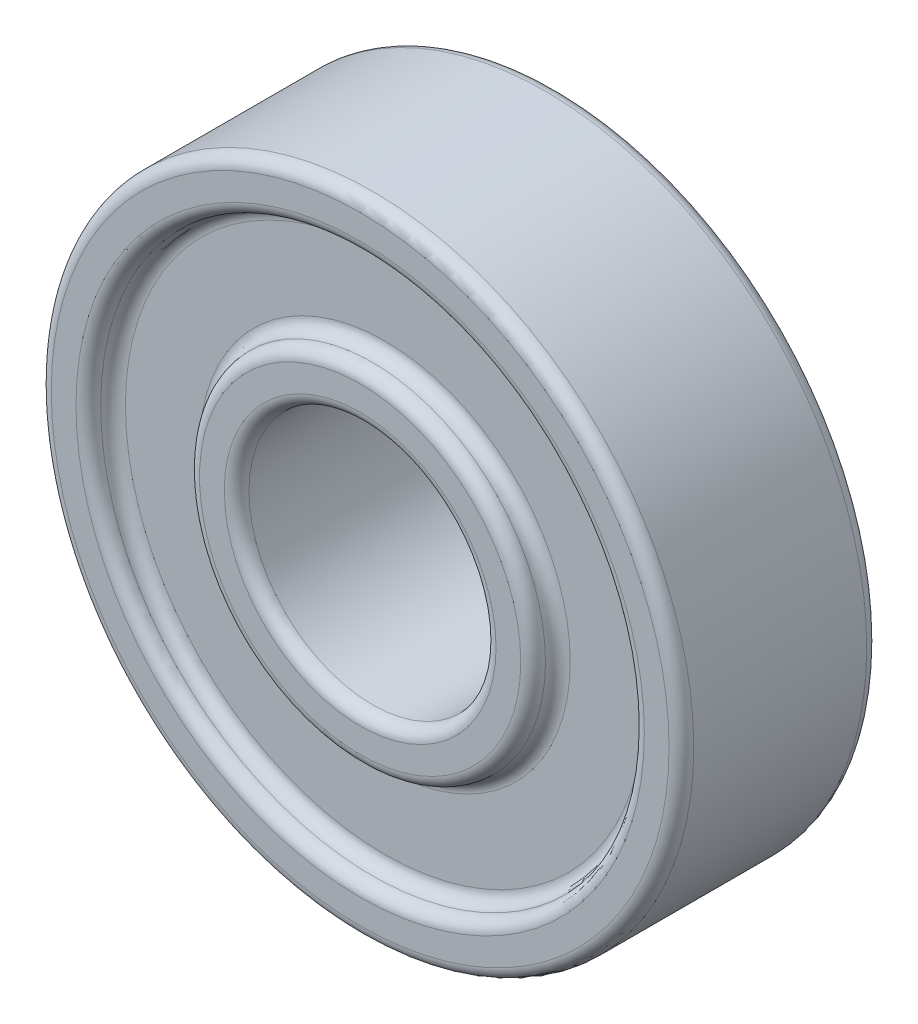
ISO-10303-21;
HEADER;
FILE_DESCRIPTION(('STEP AP214'),'2;1');
FILE_NAME('part.step','',(''),(''),'','','');
FILE_SCHEMA(('AUTOMOTIVE_DESIGN { 1 0 10303 214 1 1 1 1 }'));
ENDSEC;
DATA;
#1=APPLICATION_CONTEXT('core data for automotive mechanical design processes');
#2=APPLICATION_PROTOCOL_DEFINITION('international standard','automotive_design',2000,#1);
#3=PRODUCT_CONTEXT('',#1,'mechanical');
#4=PRODUCT('Part','Part','',(#3));
#5=PRODUCT_RELATED_PRODUCT_CATEGORY('part','',(#4));
#6=PRODUCT_DEFINITION_FORMATION('','',#4);
#7=PRODUCT_DEFINITION_CONTEXT('part definition',#1,'design');
#8=PRODUCT_DEFINITION('design','',#6,#7);
#9=PRODUCT_DEFINITION_SHAPE('','',#8);
#10=(LENGTH_UNIT() NAMED_UNIT(*) SI_UNIT(.MILLI.,.METRE.));
#11=(NAMED_UNIT(*) PLANE_ANGLE_UNIT() SI_UNIT($,.RADIAN.));
#12=(NAMED_UNIT(*) SI_UNIT($,.STERADIAN.) SOLID_ANGLE_UNIT());
#13=UNCERTAINTY_MEASURE_WITH_UNIT(LENGTH_MEASURE(1.E-05),#10,'distance_accuracy_value','');
#14=(GEOMETRIC_REPRESENTATION_CONTEXT(3) GLOBAL_UNCERTAINTY_ASSIGNED_CONTEXT((#13)) GLOBAL_UNIT_ASSIGNED_CONTEXT((#10,
#11,#12)) REPRESENTATION_CONTEXT('',''));
#15=CARTESIAN_POINT('',(0.,0.,0.));
#16=DIRECTION('',(0.,0.,1.));
#17=DIRECTION('',(1.,0.,0.));
#18=AXIS2_PLACEMENT_3D('',#15,#16,#17);
#19=CARTESIAN_POINT('',(0.,0.,0.));
#20=DIRECTION('',(0.,0.,1.));
#21=DIRECTION('',(1.,0.,0.));
#22=AXIS2_PLACEMENT_3D('',#19,#20,#21);
#23=PLANE('',#22);
#24=CARTESIAN_POINT('',(0.,0.,0.));
#25=DIRECTION('',(0.,0.,1.));
#26=DIRECTION('',(1.,0.,0.));
#27=AXIS2_PLACEMENT_3D('',#24,#25,#26);
#28=CIRCLE('',#27,6.5);
#29=CARTESIAN_POINT('',(6.5,0.,0.));
#30=VERTEX_POINT('',#29);
#31=EDGE_CURVE('E68',#30,#30,#28,.F.);
#32=ORIENTED_EDGE('',*,*,#31,.T.);
#33=EDGE_LOOP('',(#32));
#34=FACE_BOUND('',#33,.T.);
#35=CARTESIAN_POINT('',(0.,0.,0.));
#36=DIRECTION('',(0.,0.,1.));
#37=DIRECTION('',(1.,0.,0.));
#38=AXIS2_PLACEMENT_3D('',#35,#36,#37);
#39=CIRCLE('',#38,5.5);
#40=CARTESIAN_POINT('',(5.5,0.,0.));
#41=VERTEX_POINT('',#40);
#42=EDGE_CURVE('E71',#41,#41,#39,.T.);
#43=ORIENTED_EDGE('',*,*,#42,.T.);
#44=EDGE_LOOP('',(#43));
#45=FACE_BOUND('',#44,.T.);
#46=ADVANCED_FACE('F30',(#34,#45),#23,.F.);
#47=CARTESIAN_POINT('',(0.,0.,8.));
#48=DIRECTION('',(0.,0.,1.));
#49=DIRECTION('',(1.,0.,0.));
#50=AXIS2_PLACEMENT_3D('',#47,#48,#49);
#51=PLANE('',#50);
#52=CARTESIAN_POINT('',(0.,0.,8.));
#53=DIRECTION('',(0.,0.,1.));
#54=DIRECTION('',(1.,0.,0.));
#55=AXIS2_PLACEMENT_3D('',#52,#53,#54);
#56=CIRCLE('',#55,5.5);
#57=CARTESIAN_POINT('',(5.5,0.,8.));
#58=VERTEX_POINT('',#57);
#59=EDGE_CURVE('E56',#58,#58,#56,.F.);
#60=ORIENTED_EDGE('',*,*,#59,.T.);
#61=EDGE_LOOP('',(#60));
#62=FACE_BOUND('',#61,.T.);
#63=CARTESIAN_POINT('',(0.,0.,8.));
#64=DIRECTION('',(0.,0.,1.));
#65=DIRECTION('',(1.,0.,0.));
#66=AXIS2_PLACEMENT_3D('',#63,#64,#65);
#67=CIRCLE('',#66,6.5);
#68=CARTESIAN_POINT('',(6.5,0.,8.));
#69=VERTEX_POINT('',#68);
#70=EDGE_CURVE('E59',#69,#69,#67,.T.);
#71=ORIENTED_EDGE('',*,*,#70,.T.);
#72=EDGE_LOOP('',(#71));
#73=FACE_BOUND('',#72,.T.);
#74=ADVANCED_FACE('F116',(#62,#73),#51,.T.);
#75=CARTESIAN_POINT('',(0.,0.,8.));
#76=DIRECTION('',(0.,0.,1.));
#77=DIRECTION('',(1.,0.,0.));
#78=AXIS2_PLACEMENT_3D('',#75,#76,#77);
#79=CIRCLE('',#78,12.5);
#80=CARTESIAN_POINT('',(12.5,0.,8.));
#81=VERTEX_POINT('',#80);
#82=EDGE_CURVE('E41',#81,#81,#79,.T.);
#83=ORIENTED_EDGE('',*,*,#82,.T.);
#84=EDGE_LOOP('',(#83));
#85=FACE_BOUND('',#84,.T.);
#86=CARTESIAN_POINT('',(0.,0.,8.));
#87=DIRECTION('',(0.,0.,1.));
#88=DIRECTION('',(1.,0.,0.));
#89=AXIS2_PLACEMENT_3D('',#86,#87,#88);
#90=CIRCLE('',#89,11.5);
#91=CARTESIAN_POINT('',(11.5,0.,8.));
#92=VERTEX_POINT('',#91);
#93=EDGE_CURVE('E45',#92,#92,#90,.F.);
#94=ORIENTED_EDGE('',*,*,#93,.T.);
#95=EDGE_LOOP('',(#94));
#96=FACE_BOUND('',#95,.T.);
#97=ADVANCED_FACE('F123',(#85,#96),#51,.T.);
#98=CARTESIAN_POINT('',(0.,0.,0.));
#99=DIRECTION('',(0.,0.,1.));
#100=DIRECTION('',(1.,0.,0.));
#101=AXIS2_PLACEMENT_3D('',#98,#99,#100);
#102=CIRCLE('',#101,11.5);
#103=CARTESIAN_POINT('',(11.5,0.,0.));
#104=VERTEX_POINT('',#103);
#105=EDGE_CURVE('E74',#104,#104,#102,.T.);
#106=ORIENTED_EDGE('',*,*,#105,.T.);
#107=EDGE_LOOP('',(#106));
#108=FACE_BOUND('',#107,.T.);
#109=CARTESIAN_POINT('',(0.,0.,0.));
#110=DIRECTION('',(0.,0.,1.));
#111=DIRECTION('',(1.,0.,0.));
#112=AXIS2_PLACEMENT_3D('',#109,#110,#111);
#113=CIRCLE('',#112,12.5);
#114=CARTESIAN_POINT('',(12.5,0.,0.));
#115=VERTEX_POINT('',#114);
#116=EDGE_CURVE('E77',#115,#115,#113,.F.);
#117=ORIENTED_EDGE('',*,*,#116,.T.);
#118=EDGE_LOOP('',(#117));
#119=FACE_BOUND('',#118,.T.);
#120=ADVANCED_FACE('F119',(#108,#119),#23,.F.);
#121=CARTESIAN_POINT('',(0.,0.,8.));
#122=DIRECTION('',(0.,0.,-1.));
#123=DIRECTION('',(-1.,0.,0.));
#124=AXIS2_PLACEMENT_3D('',#121,#122,#123);
#125=CYLINDRICAL_SURFACE('',#124,13.);
#126=CARTESIAN_POINT('',(0.,0.,0.5));
#127=DIRECTION('',(0.,0.,1.));
#128=DIRECTION('',(1.,0.,0.));
#129=AXIS2_PLACEMENT_3D('',#126,#127,#128);
#130=CIRCLE('',#129,13.);
#131=CARTESIAN_POINT('',(13.,0.,0.5));
#132=VERTEX_POINT('',#131);
#133=EDGE_CURVE('E50',#132,#132,#130,.T.);
#134=ORIENTED_EDGE('',*,*,#133,.T.);
#135=EDGE_LOOP('',(#134));
#136=FACE_BOUND('',#135,.T.);
#137=CARTESIAN_POINT('',(0.,0.,7.5));
#138=DIRECTION('',(0.,0.,1.));
#139=DIRECTION('',(1.,0.,0.));
#140=AXIS2_PLACEMENT_3D('',#137,#138,#139);
#141=CIRCLE('',#140,13.);
#142=CARTESIAN_POINT('',(13.,0.,7.5));
#143=VERTEX_POINT('',#142);
#144=EDGE_CURVE('E53',#143,#143,#141,.F.);
#145=ORIENTED_EDGE('',*,*,#144,.T.);
#146=EDGE_LOOP('',(#145));
#147=FACE_BOUND('',#146,.T.);
#148=ADVANCED_FACE('F32',(#136,#147),#125,.T.);
#149=CARTESIAN_POINT('',(0.,0.,8.));
#150=DIRECTION('',(0.,0.,-1.));
#151=DIRECTION('',(-1.,0.,0.));
#152=AXIS2_PLACEMENT_3D('',#149,#150,#151);
#153=CYLINDRICAL_SURFACE('',#152,5.);
#154=CARTESIAN_POINT('',(0.,0.,0.5));
#155=DIRECTION('',(0.,0.,1.));
#156=DIRECTION('',(1.,0.,0.));
#157=AXIS2_PLACEMENT_3D('',#154,#155,#156);
#158=CIRCLE('',#157,5.);
#159=CARTESIAN_POINT('',(5.,0.,0.5));
#160=VERTEX_POINT('',#159);
#161=EDGE_CURVE('E62',#160,#160,#158,.F.);
#162=ORIENTED_EDGE('',*,*,#161,.T.);
#163=EDGE_LOOP('',(#162));
#164=FACE_BOUND('',#163,.T.);
#165=CARTESIAN_POINT('',(0.,0.,7.5));
#166=DIRECTION('',(0.,0.,1.));
#167=DIRECTION('',(1.,0.,0.));
#168=AXIS2_PLACEMENT_3D('',#165,#166,#167);
#169=CIRCLE('',#168,5.);
#170=CARTESIAN_POINT('',(5.,0.,7.5));
#171=VERTEX_POINT('',#170);
#172=EDGE_CURVE('E65',#171,#171,#169,.T.);
#173=ORIENTED_EDGE('',*,*,#172,.T.);
#174=EDGE_LOOP('',(#173));
#175=FACE_BOUND('',#174,.T.);
#176=ADVANCED_FACE('F133',(#164,#175),#153,.F.);
#177=CARTESIAN_POINT('',(0.,0.,7.));
#178=DIRECTION('',(0.,0.,1.));
#179=DIRECTION('',(1.,0.,0.));
#180=AXIS2_PLACEMENT_3D('',#177,#178,#179);
#181=PLANE('',#180);
#182=CARTESIAN_POINT('',(0.,0.,7.));
#183=DIRECTION('',(0.,0.,1.));
#184=DIRECTION('',(1.,0.,0.));
#185=AXIS2_PLACEMENT_3D('',#182,#183,#184);
#186=CIRCLE('',#185,7.5);
#187=CARTESIAN_POINT('',(7.5,0.,7.));
#188=VERTEX_POINT('',#187);
#189=EDGE_CURVE('E10',#188,#188,#186,.F.);
#190=ORIENTED_EDGE('',*,*,#189,.T.);
#191=EDGE_LOOP('',(#190));
#192=FACE_BOUND('',#191,.T.);
#193=CARTESIAN_POINT('',(0.,0.,7.));
#194=DIRECTION('',(0.,0.,1.));
#195=DIRECTION('',(1.,0.,0.));
#196=AXIS2_PLACEMENT_3D('',#193,#194,#195);
#197=CIRCLE('',#196,10.5);
#198=CARTESIAN_POINT('',(10.5,0.,7.));
#199=VERTEX_POINT('',#198);
#200=EDGE_CURVE('E37',#199,#199,#197,.T.);
#201=ORIENTED_EDGE('',*,*,#200,.T.);
#202=EDGE_LOOP('',(#201));
#203=FACE_BOUND('',#202,.T.);
#204=ADVANCED_FACE('F188',(#192,#203),#181,.T.);
#205=CARTESIAN_POINT('',(0.,0.,1.));
#206=DIRECTION('',(0.,0.,-1.));
#207=DIRECTION('',(-1.,0.,0.));
#208=AXIS2_PLACEMENT_3D('',#205,#206,#207);
#209=PLANE('',#208);
#210=CARTESIAN_POINT('',(0.,0.,1.));
#211=DIRECTION('',(0.,0.,-1.));
#212=DIRECTION('',(-1.,0.,0.));
#213=AXIS2_PLACEMENT_3D('',#210,#211,#212);
#214=CIRCLE('',#213,10.5);
#215=CARTESIAN_POINT('',(-10.5,0.,1.));
#216=VERTEX_POINT('',#215);
#217=EDGE_CURVE('E80',#216,#216,#214,.T.);
#218=ORIENTED_EDGE('',*,*,#217,.T.);
#219=EDGE_LOOP('',(#218));
#220=FACE_BOUND('',#219,.T.);
#221=CARTESIAN_POINT('',(0.,0.,1.));
#222=DIRECTION('',(0.,0.,-1.));
#223=DIRECTION('',(-1.,0.,0.));
#224=AXIS2_PLACEMENT_3D('',#221,#222,#223);
#225=CIRCLE('',#224,7.5);
#226=CARTESIAN_POINT('',(-7.5,0.,1.));
#227=VERTEX_POINT('',#226);
#228=EDGE_CURVE('E83',#227,#227,#225,.F.);
#229=ORIENTED_EDGE('',*,*,#228,.T.);
#230=EDGE_LOOP('',(#229));
#231=FACE_BOUND('',#230,.T.);
#232=ADVANCED_FACE('F184',(#220,#231),#209,.T.);
#233=CARTESIAN_POINT('',(0.,0.,0.5));
#234=DIRECTION('',(0.,0.,1.));
#235=DIRECTION('',(1.,0.,0.));
#236=AXIS2_PLACEMENT_3D('',#233,#234,#235);
#237=TOROIDAL_SURFACE('',#236,11.5,0.5);
#238=ORIENTED_EDGE('',*,*,#105,.F.);
#239=EDGE_LOOP('',(#238));
#240=FACE_BOUND('',#239,.T.);
#241=CARTESIAN_POINT('',(0.,0.,0.5));
#242=DIRECTION('',(0.,0.,1.));
#243=DIRECTION('',(1.,0.,0.));
#244=AXIS2_PLACEMENT_3D('',#241,#242,#243);
#245=CIRCLE('',#244,11.);
#246=CARTESIAN_POINT('',(11.,0.,0.5));
#247=VERTEX_POINT('',#246);
#248=EDGE_CURVE('E86',#247,#247,#245,.F.);
#249=ORIENTED_EDGE('',*,*,#248,.F.);
#250=EDGE_LOOP('',(#249));
#251=FACE_BOUND('',#250,.T.);
#252=ADVANCED_FACE('F180',(#240,#251),#237,.T.);
#253=CARTESIAN_POINT('',(0.,0.,0.5));
#254=DIRECTION('',(0.,0.,-1.));
#255=DIRECTION('',(-1.,0.,0.));
#256=AXIS2_PLACEMENT_3D('',#253,#254,#255);
#257=TOROIDAL_SURFACE('',#256,10.5,0.5);
#258=ORIENTED_EDGE('',*,*,#248,.T.);
#259=EDGE_LOOP('',(#258));
#260=FACE_BOUND('',#259,.T.);
#261=ORIENTED_EDGE('',*,*,#217,.F.);
#262=EDGE_LOOP('',(#261));
#263=FACE_BOUND('',#262,.T.);
#264=ADVANCED_FACE('F176',(#260,#263),#257,.F.);
#265=CARTESIAN_POINT('',(0.,0.,0.5));
#266=DIRECTION('',(0.,0.,-1.));
#267=DIRECTION('',(-1.,0.,0.));
#268=AXIS2_PLACEMENT_3D('',#265,#266,#267);
#269=TOROIDAL_SURFACE('',#268,7.5,0.5);
#270=ORIENTED_EDGE('',*,*,#228,.F.);
#271=EDGE_LOOP('',(#270));
#272=FACE_BOUND('',#271,.T.);
#273=CARTESIAN_POINT('',(0.,0.,0.5));
#274=DIRECTION('',(0.,0.,-1.));
#275=DIRECTION('',(-1.,0.,0.));
#276=AXIS2_PLACEMENT_3D('',#273,#274,#275);
#277=CIRCLE('',#276,7.);
#278=CARTESIAN_POINT('',(-7.,0.,0.5));
#279=VERTEX_POINT('',#278);
#280=EDGE_CURVE('E89',#279,#279,#277,.T.);
#281=ORIENTED_EDGE('',*,*,#280,.F.);
#282=EDGE_LOOP('',(#281));
#283=FACE_BOUND('',#282,.T.);
#284=ADVANCED_FACE('F172',(#272,#283),#269,.F.);
#285=CARTESIAN_POINT('',(0.,0.,0.5));
#286=DIRECTION('',(0.,0.,1.));
#287=DIRECTION('',(1.,0.,0.));
#288=AXIS2_PLACEMENT_3D('',#285,#286,#287);
#289=TOROIDAL_SURFACE('',#288,6.5,0.5);
#290=ORIENTED_EDGE('',*,*,#280,.T.);
#291=EDGE_LOOP('',(#290));
#292=FACE_BOUND('',#291,.T.);
#293=ORIENTED_EDGE('',*,*,#31,.F.);
#294=EDGE_LOOP('',(#293));
#295=FACE_BOUND('',#294,.T.);
#296=ADVANCED_FACE('F168',(#292,#295),#289,.T.);
#297=CARTESIAN_POINT('',(0.,0.,0.5));
#298=DIRECTION('',(0.,0.,1.));
#299=DIRECTION('',(1.,0.,0.));
#300=AXIS2_PLACEMENT_3D('',#297,#298,#299);
#301=TOROIDAL_SURFACE('',#300,5.5,0.5);
#302=ORIENTED_EDGE('',*,*,#161,.F.);
#303=EDGE_LOOP('',(#302));
#304=FACE_BOUND('',#303,.T.);
#305=ORIENTED_EDGE('',*,*,#42,.F.);
#306=EDGE_LOOP('',(#305));
#307=FACE_BOUND('',#306,.T.);
#308=ADVANCED_FACE('F164',(#304,#307),#301,.T.);
#309=CARTESIAN_POINT('',(0.,0.,7.5));
#310=DIRECTION('',(0.,0.,1.));
#311=DIRECTION('',(1.,0.,0.));
#312=AXIS2_PLACEMENT_3D('',#309,#310,#311);
#313=TOROIDAL_SURFACE('',#312,5.5,0.5);
#314=ORIENTED_EDGE('',*,*,#59,.F.);
#315=EDGE_LOOP('',(#314));
#316=FACE_BOUND('',#315,.T.);
#317=ORIENTED_EDGE('',*,*,#172,.F.);
#318=EDGE_LOOP('',(#317));
#319=FACE_BOUND('',#318,.T.);
#320=ADVANCED_FACE('F144',(#316,#319),#313,.T.);
#321=CARTESIAN_POINT('',(0.,0.,0.5));
#322=DIRECTION('',(0.,0.,1.));
#323=DIRECTION('',(1.,0.,0.));
#324=AXIS2_PLACEMENT_3D('',#321,#322,#323);
#325=TOROIDAL_SURFACE('',#324,12.5,0.5);
#326=ORIENTED_EDGE('',*,*,#116,.F.);
#327=EDGE_LOOP('',(#326));
#328=FACE_BOUND('',#327,.T.);
#329=ORIENTED_EDGE('',*,*,#133,.F.);
#330=EDGE_LOOP('',(#329));
#331=FACE_BOUND('',#330,.T.);
#332=ADVANCED_FACE('F140',(#328,#331),#325,.T.);
#333=CARTESIAN_POINT('',(0.,0.,7.5));
#334=DIRECTION('',(0.,0.,1.));
#335=DIRECTION('',(1.,0.,0.));
#336=AXIS2_PLACEMENT_3D('',#333,#334,#335);
#337=TOROIDAL_SURFACE('',#336,12.5,0.5);
#338=ORIENTED_EDGE('',*,*,#144,.F.);
#339=EDGE_LOOP('',(#338));
#340=FACE_BOUND('',#339,.T.);
#341=ORIENTED_EDGE('',*,*,#82,.F.);
#342=EDGE_LOOP('',(#341));
#343=FACE_BOUND('',#342,.T.);
#344=ADVANCED_FACE('F143',(#340,#343),#337,.T.);
#345=CARTESIAN_POINT('',(0.,0.,7.5));
#346=DIRECTION('',(0.,0.,1.));
#347=DIRECTION('',(1.,0.,0.));
#348=AXIS2_PLACEMENT_3D('',#345,#346,#347);
#349=TOROIDAL_SURFACE('',#348,7.5,0.5);
#350=ORIENTED_EDGE('',*,*,#189,.F.);
#351=EDGE_LOOP('',(#350));
#352=FACE_BOUND('',#351,.T.);
#353=CARTESIAN_POINT('',(0.,0.,7.5));
#354=DIRECTION('',(0.,0.,1.));
#355=DIRECTION('',(1.,0.,0.));
#356=AXIS2_PLACEMENT_3D('',#353,#354,#355);
#357=CIRCLE('',#356,7.);
#358=CARTESIAN_POINT('',(7.,0.,7.5));
#359=VERTEX_POINT('',#358);
#360=EDGE_CURVE('E92',#359,#359,#357,.T.);
#361=ORIENTED_EDGE('',*,*,#360,.F.);
#362=EDGE_LOOP('',(#361));
#363=FACE_BOUND('',#362,.T.);
#364=ADVANCED_FACE('F112',(#352,#363),#349,.F.);
#365=CARTESIAN_POINT('',(0.,0.,7.5));
#366=DIRECTION('',(0.,0.,1.));
#367=DIRECTION('',(1.,0.,0.));
#368=AXIS2_PLACEMENT_3D('',#365,#366,#367);
#369=TOROIDAL_SURFACE('',#368,6.5,0.5);
#370=ORIENTED_EDGE('',*,*,#360,.T.);
#371=EDGE_LOOP('',(#370));
#372=FACE_BOUND('',#371,.T.);
#373=ORIENTED_EDGE('',*,*,#70,.F.);
#374=EDGE_LOOP('',(#373));
#375=FACE_BOUND('',#374,.T.);
#376=ADVANCED_FACE('F103',(#372,#375),#369,.T.);
#377=CARTESIAN_POINT('',(0.,0.,7.5));
#378=DIRECTION('',(0.,0.,1.));
#379=DIRECTION('',(1.,0.,0.));
#380=AXIS2_PLACEMENT_3D('',#377,#378,#379);
#381=TOROIDAL_SURFACE('',#380,10.5,0.5);
#382=ORIENTED_EDGE('',*,*,#200,.F.);
#383=EDGE_LOOP('',(#382));
#384=FACE_BOUND('',#383,.T.);
#385=CARTESIAN_POINT('',(0.,0.,7.5));
#386=DIRECTION('',(0.,0.,1.));
#387=DIRECTION('',(1.,0.,0.));
#388=AXIS2_PLACEMENT_3D('',#385,#386,#387);
#389=CIRCLE('',#388,11.);
#390=CARTESIAN_POINT('',(11.,0.,7.5));
#391=VERTEX_POINT('',#390);
#392=EDGE_CURVE('E95',#391,#391,#389,.F.);
#393=ORIENTED_EDGE('',*,*,#392,.F.);
#394=EDGE_LOOP('',(#393));
#395=FACE_BOUND('',#394,.T.);
#396=ADVANCED_FACE('F101',(#384,#395),#381,.F.);
#397=CARTESIAN_POINT('',(0.,0.,7.5));
#398=DIRECTION('',(0.,0.,1.));
#399=DIRECTION('',(1.,0.,0.));
#400=AXIS2_PLACEMENT_3D('',#397,#398,#399);
#401=TOROIDAL_SURFACE('',#400,11.5,0.5);
#402=ORIENTED_EDGE('',*,*,#93,.F.);
#403=EDGE_LOOP('',(#402));
#404=FACE_BOUND('',#403,.T.);
#405=ORIENTED_EDGE('',*,*,#392,.T.);
#406=EDGE_LOOP('',(#405));
#407=FACE_BOUND('',#406,.T.);
#408=ADVANCED_FACE('F99',(#404,#407),#401,.T.);
#409=CLOSED_SHELL('',(#46,#74,#97,#120,#148,#176,#204,#232,#252,#264,#284,#296,#308,#320,#332,
#344,#364,#376,#396,#408));
#410=MANIFOLD_SOLID_BREP('B2',#409);
#411=ADVANCED_BREP_SHAPE_REPRESENTATION('',(#18,#410),#14);
#412=SHAPE_DEFINITION_REPRESENTATION(#9,#411);
ENDSEC;
END-ISO-10303-21;
